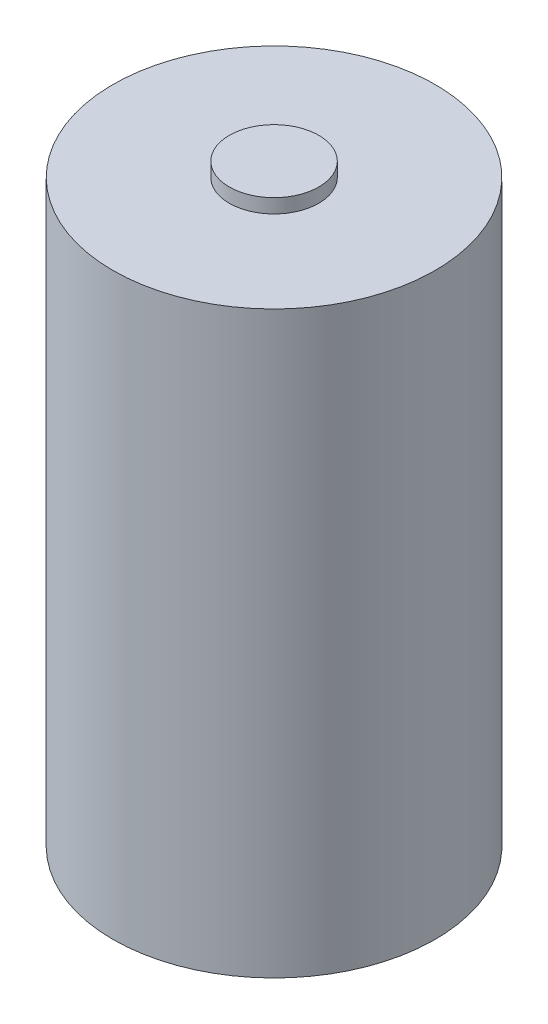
ISO-10303-21;
HEADER;
FILE_DESCRIPTION(('STEP AP214'),'2;1');
FILE_NAME('part.step','',(''),(''),'','','');
FILE_SCHEMA(('AUTOMOTIVE_DESIGN { 1 0 10303 214 1 1 1 1 }'));
ENDSEC;
DATA;
#1=APPLICATION_CONTEXT('core data for automotive mechanical design processes');
#2=APPLICATION_PROTOCOL_DEFINITION('international standard','automotive_design',2000,#1);
#3=PRODUCT_CONTEXT('',#1,'mechanical');
#4=PRODUCT('Part','Part','',(#3));
#5=PRODUCT_RELATED_PRODUCT_CATEGORY('part','',(#4));
#6=PRODUCT_DEFINITION_FORMATION('','',#4);
#7=PRODUCT_DEFINITION_CONTEXT('part definition',#1,'design');
#8=PRODUCT_DEFINITION('design','',#6,#7);
#9=PRODUCT_DEFINITION_SHAPE('','',#8);
#10=(LENGTH_UNIT() NAMED_UNIT(*) SI_UNIT(.MILLI.,.METRE.));
#11=(NAMED_UNIT(*) PLANE_ANGLE_UNIT() SI_UNIT($,.RADIAN.));
#12=(NAMED_UNIT(*) SI_UNIT($,.STERADIAN.) SOLID_ANGLE_UNIT());
#13=UNCERTAINTY_MEASURE_WITH_UNIT(LENGTH_MEASURE(1.E-05),#10,'distance_accuracy_value','');
#14=(GEOMETRIC_REPRESENTATION_CONTEXT(3) GLOBAL_UNCERTAINTY_ASSIGNED_CONTEXT((#13)) GLOBAL_UNIT_ASSIGNED_CONTEXT((#10,
#11,#12)) REPRESENTATION_CONTEXT('',''));
#15=CARTESIAN_POINT('',(0.,0.,0.));
#16=DIRECTION('',(0.,0.,1.));
#17=DIRECTION('',(1.,0.,0.));
#18=AXIS2_PLACEMENT_3D('',#15,#16,#17);
#19=CARTESIAN_POINT('',(0.,61.5,0.));
#20=DIRECTION('',(0.,1.,0.));
#21=DIRECTION('',(0.,0.,1.));
#22=AXIS2_PLACEMENT_3D('',#19,#20,#21);
#23=PLANE('',#22);
#24=CARTESIAN_POINT('',(0.,61.5,0.));
#25=DIRECTION('',(0.,1.,0.));
#26=DIRECTION('',(0.,0.,1.));
#27=AXIS2_PLACEMENT_3D('',#24,#25,#26);
#28=CIRCLE('',#27,17.1);
#29=CARTESIAN_POINT('',(0.,61.5,17.1));
#30=VERTEX_POINT('',#29);
#31=EDGE_CURVE('E10',#30,#30,#28,.T.);
#32=ORIENTED_EDGE('',*,*,#31,.T.);
#33=EDGE_LOOP('',(#32));
#34=FACE_BOUND('',#33,.T.);
#35=CARTESIAN_POINT('',(0.,61.5,0.));
#36=DIRECTION('',(0.,1.,0.));
#37=DIRECTION('',(0.,0.,1.));
#38=AXIS2_PLACEMENT_3D('',#35,#36,#37);
#39=CIRCLE('',#38,4.75);
#40=CARTESIAN_POINT('',(0.,61.5,4.75));
#41=VERTEX_POINT('',#40);
#42=EDGE_CURVE('E54',#41,#41,#39,.T.);
#43=ORIENTED_EDGE('',*,*,#42,.F.);
#44=EDGE_LOOP('',(#43));
#45=FACE_BOUND('',#44,.T.);
#46=ADVANCED_FACE('F36',(#34,#45),#23,.T.);
#47=CARTESIAN_POINT('',(0.,61.5,0.));
#48=DIRECTION('',(0.,-1.,0.));
#49=DIRECTION('',(0.,0.,-1.));
#50=AXIS2_PLACEMENT_3D('',#47,#48,#49);
#51=CYLINDRICAL_SURFACE('',#50,17.1);
#52=ORIENTED_EDGE('',*,*,#31,.F.);
#53=EDGE_LOOP('',(#52));
#54=FACE_BOUND('',#53,.T.);
#55=CARTESIAN_POINT('',(0.,0.,0.));
#56=DIRECTION('',(0.,1.,0.));
#57=DIRECTION('',(0.,0.,1.));
#58=AXIS2_PLACEMENT_3D('',#55,#56,#57);
#59=CIRCLE('',#58,17.1);
#60=CARTESIAN_POINT('',(0.,0.,17.1));
#61=VERTEX_POINT('',#60);
#62=EDGE_CURVE('E44',#61,#61,#59,.T.);
#63=ORIENTED_EDGE('',*,*,#62,.T.);
#64=EDGE_LOOP('',(#63));
#65=FACE_BOUND('',#64,.T.);
#66=ADVANCED_FACE('F38',(#54,#65),#51,.T.);
#67=CARTESIAN_POINT('',(0.,0.,0.));
#68=DIRECTION('',(0.,1.,0.));
#69=DIRECTION('',(0.,0.,1.));
#70=AXIS2_PLACEMENT_3D('',#67,#68,#69);
#71=PLANE('',#70);
#72=ORIENTED_EDGE('',*,*,#62,.F.);
#73=EDGE_LOOP('',(#72));
#74=FACE_BOUND('',#73,.T.);
#75=ADVANCED_FACE('F67',(#74),#71,.F.);
#76=CARTESIAN_POINT('',(0.,63.,0.));
#77=DIRECTION('',(0.,-1.,0.));
#78=DIRECTION('',(0.,0.,-1.));
#79=AXIS2_PLACEMENT_3D('',#76,#77,#78);
#80=CYLINDRICAL_SURFACE('',#79,4.75);
#81=CARTESIAN_POINT('',(0.,63.,0.));
#82=DIRECTION('',(0.,1.,0.));
#83=DIRECTION('',(0.,0.,1.));
#84=AXIS2_PLACEMENT_3D('',#81,#82,#83);
#85=CIRCLE('',#84,4.75);
#86=CARTESIAN_POINT('',(0.,63.,4.75));
#87=VERTEX_POINT('',#86);
#88=EDGE_CURVE('E50',#87,#87,#85,.T.);
#89=ORIENTED_EDGE('',*,*,#88,.F.);
#90=EDGE_LOOP('',(#89));
#91=FACE_BOUND('',#90,.T.);
#92=ORIENTED_EDGE('',*,*,#42,.T.);
#93=EDGE_LOOP('',(#92));
#94=FACE_BOUND('',#93,.T.);
#95=ADVANCED_FACE('F61',(#91,#94),#80,.T.);
#96=CARTESIAN_POINT('',(0.,63.,0.));
#97=DIRECTION('',(0.,1.,0.));
#98=DIRECTION('',(0.,0.,1.));
#99=AXIS2_PLACEMENT_3D('',#96,#97,#98);
#100=PLANE('',#99);
#101=ORIENTED_EDGE('',*,*,#88,.T.);
#102=EDGE_LOOP('',(#101));
#103=FACE_BOUND('',#102,.T.);
#104=ADVANCED_FACE('F75',(#103),#100,.T.);
#105=CLOSED_SHELL('',(#46,#66,#75,#95,#104));
#106=MANIFOLD_SOLID_BREP('B2',#105);
#107=ADVANCED_BREP_SHAPE_REPRESENTATION('',(#18,#106),#14);
#108=SHAPE_DEFINITION_REPRESENTATION(#9,#107);
ENDSEC;
END-ISO-10303-21;
